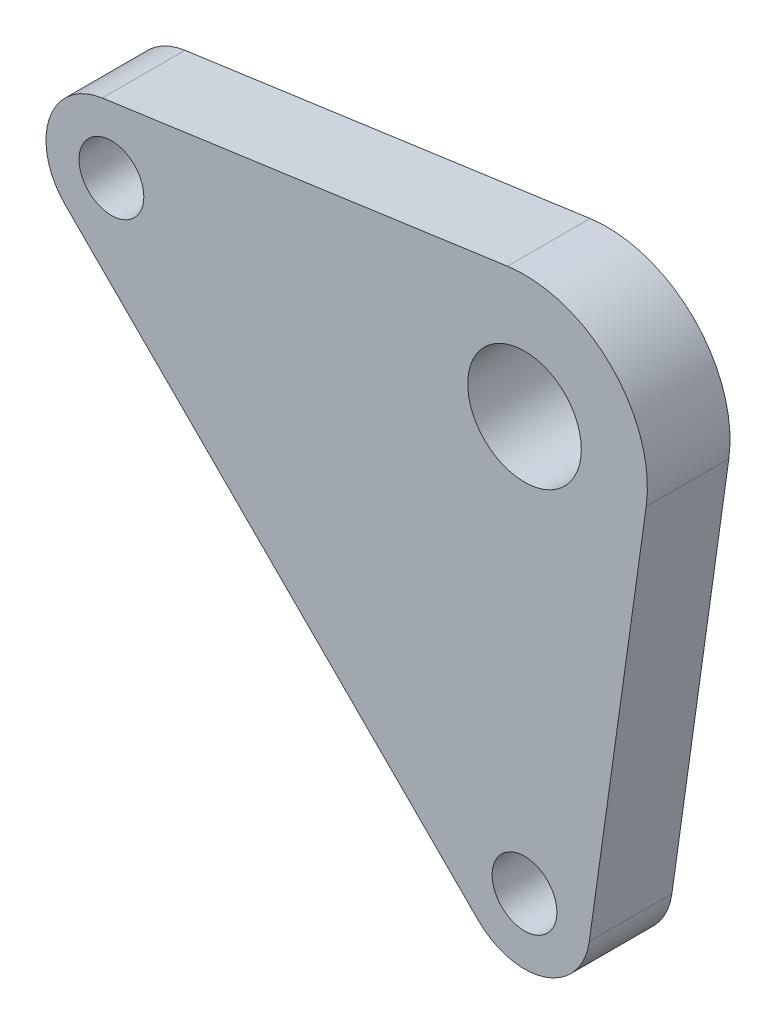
from build123d import *

# Parameters (mm, degrees)
SKETCH1_R           = 4.365625
SKETCH1_R_2         = 2.4892
BOSS_EXTRUDE1_DEPTH = 6.35


with BuildPart() as part:
    # Sketch1 → Boss-Extrude1 (new body)
    with BuildSketch(Plane.XY):
        with BuildLine():
            Line((-3.556181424, -35.306181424), (-35.306181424, -3.556181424))
            ThreePointArc((-35.306181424, -3.556181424), (-36.135369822, -2.461987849), (-36.637762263, -1.184327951))
            ThreePointArc((-36.637762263, -1.184327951), (-35.909955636, 2.826238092), (-32.44956172, 4.980307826))
            Line((-32.44956172, 4.980307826), (-1.313886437, 9.353797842))
            ThreePointArc((-1.313886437, 9.353797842), (6.67906549, 6.67906549), (9.353797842, -1.313886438))
            Line((9.353797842, -1.313886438), (4.980307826, -32.44956172))
            ThreePointArc((4.980307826, -32.44956172), (1.59596461, -36.519250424), (-3.556181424, -35.306181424))
        make_face()
        Circle(SKETCH1_R, mode=Mode.SUBTRACT)
        with Locations((-31.75, 0)):
            Circle(SKETCH1_R_2, mode=Mode.SUBTRACT)
        with Locations((0, -31.75)):
            Circle(SKETCH1_R_2, mode=Mode.SUBTRACT)
    extrude(amount=BOSS_EXTRUDE1_DEPTH)


solid = part.part
